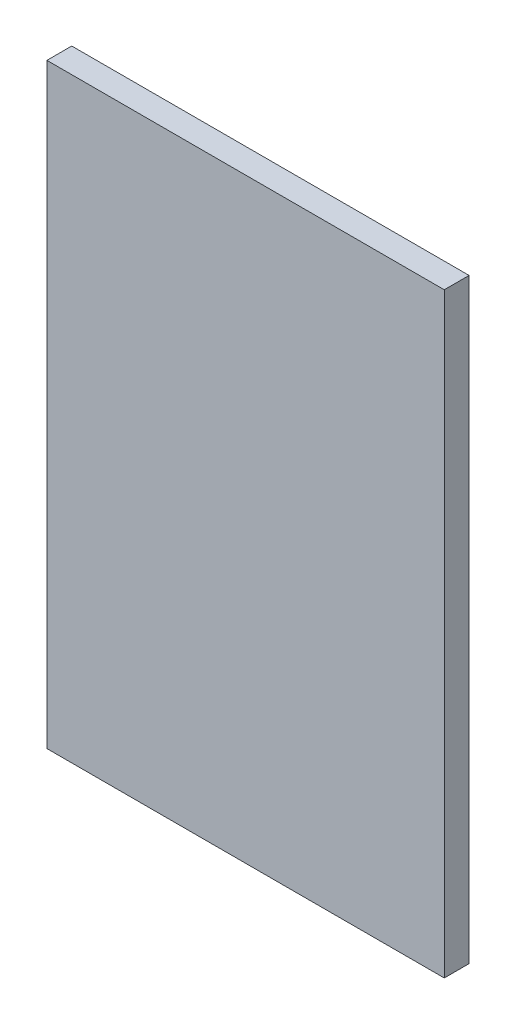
from build123d import *

# Parameters (mm, degrees)
SKETCH1_W      = 304.8
SKETCH1_H      = 457.2
EXTRUDE1_DEPTH = 19.05


with BuildPart() as part:
    # Sketch1 → Extrude1 (new body)
    with BuildSketch(Plane.XY):
        with Locations((152.4, 228.6)):
            Rectangle(SKETCH1_W, SKETCH1_H)
    extrude(amount=EXTRUDE1_DEPTH)


solid = part.part
